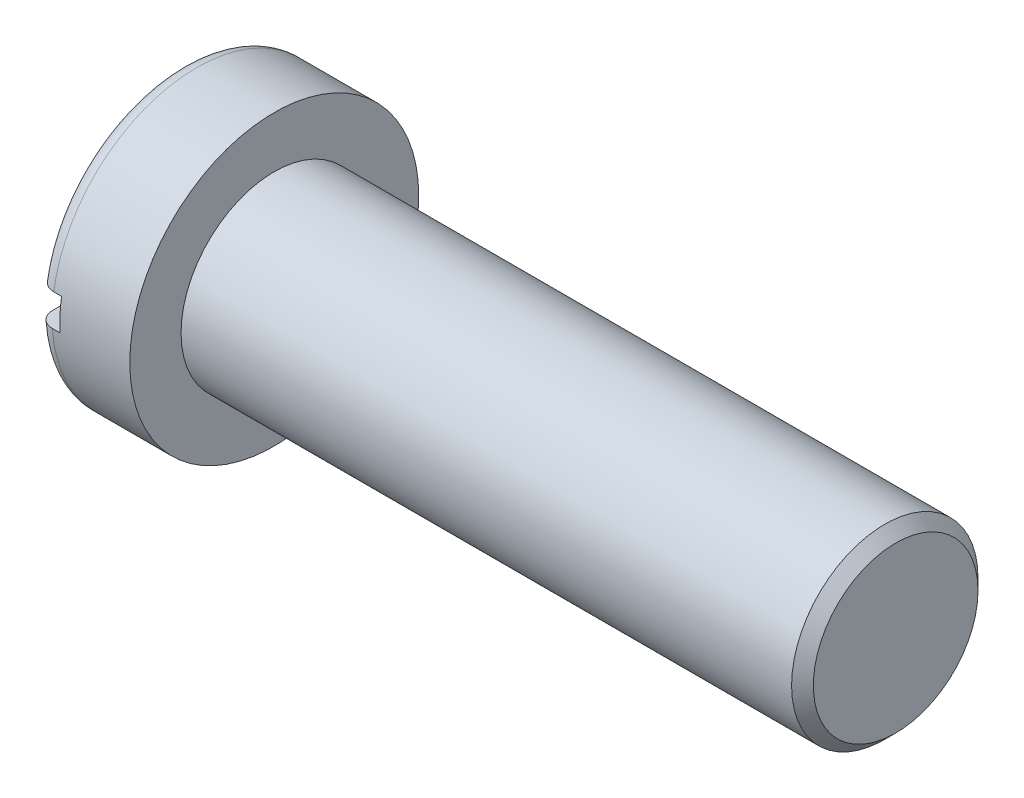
ISO-10303-21;
HEADER;
FILE_DESCRIPTION(('STEP AP214'),'2;1');
FILE_NAME('part.step','',(''),(''),'','','');
FILE_SCHEMA(('AUTOMOTIVE_DESIGN { 1 0 10303 214 1 1 1 1 }'));
ENDSEC;
DATA;
#1=APPLICATION_CONTEXT('core data for automotive mechanical design processes');
#2=APPLICATION_PROTOCOL_DEFINITION('international standard','automotive_design',2000,#1);
#3=PRODUCT_CONTEXT('',#1,'mechanical');
#4=PRODUCT('Part','Part','',(#3));
#5=PRODUCT_RELATED_PRODUCT_CATEGORY('part','',(#4));
#6=PRODUCT_DEFINITION_FORMATION('','',#4);
#7=PRODUCT_DEFINITION_CONTEXT('part definition',#1,'design');
#8=PRODUCT_DEFINITION('design','',#6,#7);
#9=PRODUCT_DEFINITION_SHAPE('','',#8);
#10=(LENGTH_UNIT() NAMED_UNIT(*) SI_UNIT(.MILLI.,.METRE.));
#11=(NAMED_UNIT(*) PLANE_ANGLE_UNIT() SI_UNIT($,.RADIAN.));
#12=(NAMED_UNIT(*) SI_UNIT($,.STERADIAN.) SOLID_ANGLE_UNIT());
#13=UNCERTAINTY_MEASURE_WITH_UNIT(LENGTH_MEASURE(1.E-05),#10,'distance_accuracy_value','');
#14=(GEOMETRIC_REPRESENTATION_CONTEXT(3) GLOBAL_UNCERTAINTY_ASSIGNED_CONTEXT((#13)) GLOBAL_UNIT_ASSIGNED_CONTEXT((#10,
#11,#12)) REPRESENTATION_CONTEXT('',''));
#15=CARTESIAN_POINT('',(0.,0.,0.));
#16=DIRECTION('',(0.,0.,1.));
#17=DIRECTION('',(1.,0.,0.));
#18=AXIS2_PLACEMENT_3D('',#15,#16,#17);
#19=CARTESIAN_POINT('',(0.,0.,0.));
#20=DIRECTION('',(-1.,0.,0.));
#21=DIRECTION('',(0.,0.,1.));
#22=AXIS2_PLACEMENT_3D('',#19,#20,#21);
#23=PLANE('',#22);
#24=DIRECTION('',(0.,0.,1.));
#25=VECTOR('',#24,1.);
#26=CARTESIAN_POINT('',(0.,-0.3,-5.));
#27=LINE('',#26,#25);
#28=CARTESIAN_POINT('',(0.,-0.3,-4.1391424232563));
#29=VERTEX_POINT('',#28);
#30=CARTESIAN_POINT('',(0.,-0.3,4.1391424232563));
#31=VERTEX_POINT('',#30);
#32=EDGE_CURVE('E121',#29,#31,#27,.T.);
#33=ORIENTED_EDGE('',*,*,#32,.F.);
#34=CARTESIAN_POINT('',(0.,0.,0.));
#35=DIRECTION('',(-1.,0.,0.));
#36=DIRECTION('',(0.,0.,1.));
#37=AXIS2_PLACEMENT_3D('',#34,#35,#36);
#38=CIRCLE('',#37,4.15);
#39=EDGE_CURVE('E99',#29,#31,#38,.T.);
#40=ORIENTED_EDGE('',*,*,#39,.T.);
#41=EDGE_LOOP('',(#33,#40));
#42=FACE_BOUND('',#41,.T.);
#43=ADVANCED_FACE('F32',(#42),#23,.T.);
#44=DIRECTION('',(0.,0.,1.));
#45=VECTOR('',#44,1.);
#46=CARTESIAN_POINT('',(0.,0.7,-5.));
#47=LINE('',#46,#45);
#48=CARTESIAN_POINT('',(0.,0.7,-4.09053786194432));
#49=VERTEX_POINT('',#48);
#50=CARTESIAN_POINT('',(0.,0.7,4.09053786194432));
#51=VERTEX_POINT('',#50);
#52=EDGE_CURVE('E117',#49,#51,#47,.T.);
#53=ORIENTED_EDGE('',*,*,#52,.T.);
#54=CARTESIAN_POINT('',(0.,0.,0.));
#55=DIRECTION('',(-1.,0.,0.));
#56=DIRECTION('',(0.,0.,1.));
#57=AXIS2_PLACEMENT_3D('',#54,#55,#56);
#58=CIRCLE('',#57,4.15);
#59=EDGE_CURVE('E188',#51,#49,#58,.T.);
#60=ORIENTED_EDGE('',*,*,#59,.T.);
#61=EDGE_LOOP('',(#53,#60));
#62=FACE_BOUND('',#61,.T.);
#63=ADVANCED_FACE('F179',(#62),#23,.T.);
#64=CARTESIAN_POINT('',(0.,0.,0.));
#65=DIRECTION('',(-1.,0.,0.));
#66=DIRECTION('',(0.,0.,1.));
#67=AXIS2_PLACEMENT_3D('',#64,#65,#66);
#68=CYLINDRICAL_SURFACE('',#67,4.65);
#69=CARTESIAN_POINT('',(3.,0.,0.));
#70=DIRECTION('',(-1.,0.,0.));
#71=DIRECTION('',(0.,0.,1.));
#72=AXIS2_PLACEMENT_3D('',#69,#70,#71);
#73=CIRCLE('',#72,4.65);
#74=CARTESIAN_POINT('',(3.,0.,4.65));
#75=VERTEX_POINT('',#74);
#76=EDGE_CURVE('E126',#75,#75,#73,.T.);
#77=ORIENTED_EDGE('',*,*,#76,.T.);
#78=EDGE_LOOP('',(#77));
#79=FACE_BOUND('',#78,.T.);
#80=DIRECTION('',(-1.,0.,0.));
#81=VECTOR('',#80,1.);
#82=CARTESIAN_POINT('',(0.,-0.3,4.64031248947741));
#83=LINE('',#82,#81);
#84=CARTESIAN_POINT('',(0.75,-0.3,4.64031248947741));
#85=VERTEX_POINT('',#84);
#86=CARTESIAN_POINT('',(0.5,-0.3,4.64031248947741));
#87=VERTEX_POINT('',#86);
#88=EDGE_CURVE('E110',#85,#87,#83,.T.);
#89=ORIENTED_EDGE('',*,*,#88,.T.);
#90=CARTESIAN_POINT('',(0.5,0.,0.));
#91=DIRECTION('',(-1.,0.,0.));
#92=DIRECTION('',(0.,0.,1.));
#93=AXIS2_PLACEMENT_3D('',#90,#91,#92);
#94=CIRCLE('',#93,4.65);
#95=CARTESIAN_POINT('',(0.5,-0.3,-4.64031248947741));
#96=VERTEX_POINT('',#95);
#97=EDGE_CURVE('E95',#87,#96,#94,.F.);
#98=ORIENTED_EDGE('',*,*,#97,.T.);
#99=DIRECTION('',(-1.,0.,0.));
#100=VECTOR('',#99,1.);
#101=CARTESIAN_POINT('',(0.,-0.3,-4.64031248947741));
#102=LINE('',#101,#100);
#103=CARTESIAN_POINT('',(0.75,-0.3,-4.64031248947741));
#104=VERTEX_POINT('',#103);
#105=EDGE_CURVE('E88',#96,#104,#102,.F.);
#106=ORIENTED_EDGE('',*,*,#105,.T.);
#107=CARTESIAN_POINT('',(0.75,0.,0.));
#108=DIRECTION('',(-1.,0.,0.));
#109=DIRECTION('',(0.,-1.,0.));
#110=AXIS2_PLACEMENT_3D('',#107,#108,#109);
#111=CIRCLE('',#110,4.65);
#112=CARTESIAN_POINT('',(0.75,0.7,-4.59700989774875));
#113=VERTEX_POINT('',#112);
#114=EDGE_CURVE('E93',#104,#113,#111,.F.);
#115=ORIENTED_EDGE('',*,*,#114,.T.);
#116=DIRECTION('',(-1.,0.,0.));
#117=VECTOR('',#116,1.);
#118=CARTESIAN_POINT('',(0.,0.7,-4.59700989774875));
#119=LINE('',#118,#117);
#120=CARTESIAN_POINT('',(0.5,0.7,-4.59700989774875));
#121=VERTEX_POINT('',#120);
#122=EDGE_CURVE('E100',#113,#121,#119,.T.);
#123=ORIENTED_EDGE('',*,*,#122,.T.);
#124=CARTESIAN_POINT('',(0.5,0.,0.));
#125=DIRECTION('',(-1.,0.,0.));
#126=DIRECTION('',(0.,0.,1.));
#127=AXIS2_PLACEMENT_3D('',#124,#125,#126);
#128=CIRCLE('',#127,4.65);
#129=CARTESIAN_POINT('',(0.5,0.7,4.59700989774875));
#130=VERTEX_POINT('',#129);
#131=EDGE_CURVE('E187',#121,#130,#128,.F.);
#132=ORIENTED_EDGE('',*,*,#131,.T.);
#133=DIRECTION('',(-1.,0.,0.));
#134=VECTOR('',#133,1.);
#135=CARTESIAN_POINT('',(0.,0.7,4.59700989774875));
#136=LINE('',#135,#134);
#137=CARTESIAN_POINT('',(0.75,0.7,4.59700989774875));
#138=VERTEX_POINT('',#137);
#139=EDGE_CURVE('E129',#130,#138,#136,.F.);
#140=ORIENTED_EDGE('',*,*,#139,.T.);
#141=EDGE_CURVE('E112',#138,#85,#111,.F.);
#142=ORIENTED_EDGE('',*,*,#141,.T.);
#143=EDGE_LOOP('',(#89,#98,#106,#115,#123,#132,#140,#142));
#144=FACE_BOUND('',#143,.T.);
#145=ADVANCED_FACE('F91',(#79,#144),#68,.T.);
#146=CARTESIAN_POINT('',(3.,4.65,0.));
#147=DIRECTION('',(1.,0.,0.));
#148=DIRECTION('',(0.,0.,-1.));
#149=AXIS2_PLACEMENT_3D('',#146,#147,#148);
#150=PLANE('',#149);
#151=CARTESIAN_POINT('',(3.,0.,0.));
#152=DIRECTION('',(-1.,0.,0.));
#153=DIRECTION('',(0.,0.,1.));
#154=AXIS2_PLACEMENT_3D('',#151,#152,#153);
#155=CIRCLE('',#154,3.);
#156=CARTESIAN_POINT('',(3.,0.,3.));
#157=VERTEX_POINT('',#156);
#158=EDGE_CURVE('E123',#157,#157,#155,.T.);
#159=ORIENTED_EDGE('',*,*,#158,.T.);
#160=EDGE_LOOP('',(#159));
#161=FACE_BOUND('',#160,.T.);
#162=ORIENTED_EDGE('',*,*,#76,.F.);
#163=EDGE_LOOP('',(#162));
#164=FACE_BOUND('',#163,.T.);
#165=ADVANCED_FACE('F193',(#161,#164),#150,.T.);
#166=CARTESIAN_POINT('',(0.,0.,0.));
#167=DIRECTION('',(-1.,0.,0.));
#168=DIRECTION('',(0.,0.,1.));
#169=AXIS2_PLACEMENT_3D('',#166,#167,#168);
#170=CYLINDRICAL_SURFACE('',#169,3.);
#171=CARTESIAN_POINT('',(22.65,0.,0.));
#172=DIRECTION('',(1.,0.,0.));
#173=DIRECTION('',(0.,0.,-1.));
#174=AXIS2_PLACEMENT_3D('',#171,#172,#173);
#175=CIRCLE('',#174,3.);
#176=CARTESIAN_POINT('',(22.65,0.,-3.));
#177=VERTEX_POINT('',#176);
#178=EDGE_CURVE('E40',#177,#177,#175,.F.);
#179=ORIENTED_EDGE('',*,*,#178,.T.);
#180=EDGE_LOOP('',(#179));
#181=FACE_BOUND('',#180,.T.);
#182=ORIENTED_EDGE('',*,*,#158,.F.);
#183=EDGE_LOOP('',(#182));
#184=FACE_BOUND('',#183,.T.);
#185=ADVANCED_FACE('F198',(#181,#184),#170,.T.);
#186=CARTESIAN_POINT('',(23.,3.,0.));
#187=DIRECTION('',(1.,0.,0.));
#188=DIRECTION('',(0.,0.,-1.));
#189=AXIS2_PLACEMENT_3D('',#186,#187,#188);
#190=PLANE('',#189);
#191=CARTESIAN_POINT('',(23.,0.,0.));
#192=DIRECTION('',(1.,0.,0.));
#193=DIRECTION('',(0.,0.,-1.));
#194=AXIS2_PLACEMENT_3D('',#191,#192,#193);
#195=CIRCLE('',#194,2.65);
#196=CARTESIAN_POINT('',(23.,0.,-2.65));
#197=VERTEX_POINT('',#196);
#198=EDGE_CURVE('E11',#197,#197,#195,.T.);
#199=ORIENTED_EDGE('',*,*,#198,.T.);
#200=EDGE_LOOP('',(#199));
#201=FACE_BOUND('',#200,.T.);
#202=ADVANCED_FACE('F203',(#201),#190,.T.);
#203=CARTESIAN_POINT('',(0.75,-0.3,-5.));
#204=DIRECTION('',(0.,1.,0.));
#205=DIRECTION('',(-1.,0.,0.));
#206=AXIS2_PLACEMENT_3D('',#203,#204,#205);
#207=PLANE('',#206);
#208=ORIENTED_EDGE('',*,*,#32,.T.);
#209=CARTESIAN_POINT('',(0.,-0.3,4.1391424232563));
#210=CARTESIAN_POINT('',(-2.37243173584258E-05,-0.3,4.16738834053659));
#211=CARTESIAN_POINT('',(0.0023795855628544,-0.3,4.19562776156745));
#212=CARTESIAN_POINT('',(0.0118675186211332,-0.3,4.25128949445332));
#213=CARTESIAN_POINT('',(0.0189488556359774,-0.3,4.27871236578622));
#214=CARTESIAN_POINT('',(0.0376253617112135,-0.3,4.33199250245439));
#215=CARTESIAN_POINT('',(0.0492228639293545,-0.3,4.35784895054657));
#216=CARTESIAN_POINT('',(0.0765962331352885,-0.3,4.40723943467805));
#217=CARTESIAN_POINT('',(0.092371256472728,-0.3,4.43077393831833));
#218=CARTESIAN_POINT('',(0.127633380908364,-0.3,4.47482223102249));
#219=CARTESIAN_POINT('',(0.147115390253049,-0.3,4.49534009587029));
#220=CARTESIAN_POINT('',(0.189259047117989,-0.3,4.53280914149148));
#221=CARTESIAN_POINT('',(0.211921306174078,-0.3,4.54975963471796));
#222=CARTESIAN_POINT('',(0.259725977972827,-0.3,4.5795699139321));
#223=CARTESIAN_POINT('',(0.284863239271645,-0.3,4.59243797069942));
#224=CARTESIAN_POINT('',(0.336938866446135,-0.3,4.61375546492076));
#225=CARTESIAN_POINT('',(0.363876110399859,-0.3,4.62220762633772));
#226=CARTESIAN_POINT('',(0.409153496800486,-0.3,4.63231373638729));
#227=CARTESIAN_POINT('',(0.427205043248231,-0.3,4.63531147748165));
#228=CARTESIAN_POINT('',(0.463501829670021,-0.3,4.63931055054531));
#229=CARTESIAN_POINT('',(0.481746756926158,-0.3,4.64031472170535));
#230=CARTESIAN_POINT('',(0.5,-0.3,4.64031248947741));
#231=B_SPLINE_CURVE_WITH_KNOTS('',3,(#209,#210,#211,#212,#213,#214,#215,#216,#217,#218,#219,
#220,#221,#222,#223,#224,#225,#226,#227,#228,#229,#230),.UNSPECIFIED.,.F.,.F.,(4,2,2,2,2,2,2,2,
2,2,4),(0.,0.0846264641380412,0.169193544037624,0.25380437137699,0.338398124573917,
0.422876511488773,0.507371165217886,0.59169352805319,0.675963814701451,0.730757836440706,
0.78547376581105),.UNSPECIFIED.);
#232=EDGE_CURVE('E142',#31,#87,#231,.T.);
#233=ORIENTED_EDGE('',*,*,#232,.T.);
#234=ORIENTED_EDGE('',*,*,#88,.F.);
#235=DIRECTION('',(0.,0.,1.));
#236=VECTOR('',#235,1.);
#237=CARTESIAN_POINT('',(0.75,-0.3,-5.));
#238=LINE('',#237,#236);
#239=EDGE_CURVE('E106',#104,#85,#238,.T.);
#240=ORIENTED_EDGE('',*,*,#239,.F.);
#241=ORIENTED_EDGE('',*,*,#105,.F.);
#242=CARTESIAN_POINT('',(0.5,-0.3,-4.64031248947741));
#243=CARTESIAN_POINT('',(0.471914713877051,-0.3,-4.6403366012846));
#244=CARTESIAN_POINT('',(0.443836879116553,-0.3,-4.63794265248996));
#245=CARTESIAN_POINT('',(0.38849908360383,-0.3,-4.62849692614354));
#246=CARTESIAN_POINT('',(0.361238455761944,-0.3,-4.62144906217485));
#247=CARTESIAN_POINT('',(0.308276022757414,-0.3,-4.60286895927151));
#248=CARTESIAN_POINT('',(0.282574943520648,-0.3,-4.59133465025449));
#249=CARTESIAN_POINT('',(0.233475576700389,-0.3,-4.56412194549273));
#250=CARTESIAN_POINT('',(0.210076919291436,-0.3,-4.54844421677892));
#251=CARTESIAN_POINT('',(0.166219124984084,-0.3,-4.51337459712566));
#252=CARTESIAN_POINT('',(0.145762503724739,-0.3,-4.49397956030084));
#253=CARTESIAN_POINT('',(0.10838388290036,-0.3,-4.4520322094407));
#254=CARTESIAN_POINT('',(0.091462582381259,-0.3,-4.42947927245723));
#255=CARTESIAN_POINT('',(0.0616008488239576,-0.3,-4.38180996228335));
#256=CARTESIAN_POINT('',(0.0486692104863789,-0.3,-4.35668808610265));
#257=CARTESIAN_POINT('',(0.0272027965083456,-0.3,-4.30463779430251));
#258=CARTESIAN_POINT('',(0.0186656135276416,-0.3,-4.27771037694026));
#259=CARTESIAN_POINT('',(0.00830715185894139,-0.3,-4.232044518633));
#260=CARTESIAN_POINT('',(0.00519372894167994,-0.3,-4.2135886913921));
#261=CARTESIAN_POINT('',(0.00104039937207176,-0.3,-4.17647189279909));
#262=CARTESIAN_POINT('',(-2.4586832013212E-06,-0.3,-4.15781125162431));
#263=CARTESIAN_POINT('',(0.,-0.3,-4.1391424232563));
#264=B_SPLINE_CURVE_WITH_KNOTS('',3,(#242,#243,#244,#245,#246,#247,#248,#249,#250,#251,#252,
#253,#254,#255,#256,#257,#258,#259,#260,#261,#262,#263),.UNSPECIFIED.,.F.,.F.,(4,2,2,2,2,2,2,2,
2,2,4),(0.,0.0841432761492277,0.16821588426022,0.252327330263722,0.33642524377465,
0.420594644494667,0.504780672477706,0.589150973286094,0.673475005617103,0.729516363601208,
0.785477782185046),.UNSPECIFIED.);
#265=EDGE_CURVE('E135',#96,#29,#264,.T.);
#266=ORIENTED_EDGE('',*,*,#265,.T.);
#267=EDGE_LOOP('',(#208,#233,#234,#240,#241,#266));
#268=FACE_BOUND('',#267,.T.);
#269=ADVANCED_FACE('F114',(#268),#207,.T.);
#270=CARTESIAN_POINT('',(0.,0.7,-5.));
#271=DIRECTION('',(0.,-1.,0.));
#272=DIRECTION('',(0.,0.,-1.));
#273=AXIS2_PLACEMENT_3D('',#270,#271,#272);
#274=PLANE('',#273);
#275=ORIENTED_EDGE('',*,*,#52,.F.);
#276=CARTESIAN_POINT('',(0.,0.7,-4.09053786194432));
#277=CARTESIAN_POINT('',(-2.29548473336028E-05,0.7,-4.11931908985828));
#278=CARTESIAN_POINT('',(0.00241309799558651,0.7,-4.14809679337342));
#279=CARTESIAN_POINT('',(0.0120469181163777,0.7,-4.20483475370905));
#280=CARTESIAN_POINT('',(0.0192431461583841,0.7,-4.23279527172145));
#281=CARTESIAN_POINT('',(0.0382477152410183,0.7,-4.28712672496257));
#282=CARTESIAN_POINT('',(0.0500592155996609,0.7,-4.31349655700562));
#283=CARTESIAN_POINT('',(0.0779706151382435,0.7,-4.36385024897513));
#284=CARTESIAN_POINT('',(0.0940691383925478,0.7,-4.38783487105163));
#285=CARTESIAN_POINT('',(0.129977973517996,0.7,-4.43254075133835));
#286=CARTESIAN_POINT('',(0.14975887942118,0.7,-4.4532856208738));
#287=CARTESIAN_POINT('',(0.192566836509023,0.7,-4.49111400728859));
#288=CARTESIAN_POINT('',(0.215594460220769,0.7,-4.50819687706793));
#289=CARTESIAN_POINT('',(0.263933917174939,0.7,-4.53799023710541));
#290=CARTESIAN_POINT('',(0.289214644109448,0.7,-4.55075126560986));
#291=CARTESIAN_POINT('',(0.341568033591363,0.7,-4.57179080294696));
#292=CARTESIAN_POINT('',(0.368639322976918,0.7,-4.58007270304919));
#293=CARTESIAN_POINT('',(0.413255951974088,0.7,-4.58965343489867));
#294=CARTESIAN_POINT('',(0.430501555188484,0.7,-4.59241057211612));
#295=CARTESIAN_POINT('',(0.465162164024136,0.7,-4.59608834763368));
#296=CARTESIAN_POINT('',(0.482576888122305,0.7,-4.59701163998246));
#297=CARTESIAN_POINT('',(0.5,0.7,-4.59700989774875));
#298=B_SPLINE_CURVE_WITH_KNOTS('',3,(#276,#277,#278,#279,#280,#281,#282,#283,#284,#285,#286,
#287,#288,#289,#290,#291,#292,#293,#294,#295,#296,#297),.UNSPECIFIED.,.F.,.F.,(4,2,2,2,2,2,2,2,
2,2,4),(0.,0.0862361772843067,0.172444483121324,0.258711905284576,0.344951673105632,
0.43053021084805,0.516123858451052,0.600678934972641,0.685169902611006,0.737474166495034,
0.789702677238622),.UNSPECIFIED.);
#299=EDGE_CURVE('E55',#49,#121,#298,.T.);
#300=ORIENTED_EDGE('',*,*,#299,.T.);
#301=ORIENTED_EDGE('',*,*,#122,.F.);
#302=DIRECTION('',(0.,0.,1.));
#303=VECTOR('',#302,1.);
#304=CARTESIAN_POINT('',(0.75,0.7,-5.));
#305=LINE('',#304,#303);
#306=EDGE_CURVE('E109',#113,#138,#305,.T.);
#307=ORIENTED_EDGE('',*,*,#306,.T.);
#308=ORIENTED_EDGE('',*,*,#139,.F.);
#309=CARTESIAN_POINT('',(0.5,0.7,4.59700989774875));
#310=CARTESIAN_POINT('',(0.472110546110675,0.7,4.59703498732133));
#311=CARTESIAN_POINT('',(0.444229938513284,0.7,4.59465109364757));
#312=CARTESIAN_POINT('',(0.389290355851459,0.7,4.58525248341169));
#313=CARTESIAN_POINT('',(0.362230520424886,0.7,4.57824280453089));
#314=CARTESIAN_POINT('',(0.309662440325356,0.7,4.55977552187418));
#315=CARTESIAN_POINT('',(0.284154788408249,0.7,4.54831623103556));
#316=CARTESIAN_POINT('',(0.235415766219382,0.7,4.52130016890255));
#317=CARTESIAN_POINT('',(0.212184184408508,0.7,4.50574377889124));
#318=CARTESIAN_POINT('',(0.168529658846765,0.7,4.47090537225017));
#319=CARTESIAN_POINT('',(0.148120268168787,0.7,4.45160637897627));
#320=CARTESIAN_POINT('',(0.110785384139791,0.7,4.40988526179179));
#321=CARTESIAN_POINT('',(0.0938606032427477,0.7,4.38746250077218));
#322=CARTESIAN_POINT('',(0.0637773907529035,0.7,4.33987207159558));
#323=CARTESIAN_POINT('',(0.0506627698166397,0.7,4.31467674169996));
#324=CARTESIAN_POINT('',(0.0287964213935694,0.7,4.26246352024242));
#325=CARTESIAN_POINT('',(0.0200430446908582,0.7,4.23544632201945));
#326=CARTESIAN_POINT('',(0.00906438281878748,0.7,4.18867592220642));
#327=CARTESIAN_POINT('',(0.00566647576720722,0.7,4.16918930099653));
#328=CARTESIAN_POINT('',(0.00113443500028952,0.7,4.12998335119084));
#329=CARTESIAN_POINT('',(-2.99131680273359E-06,0.7,4.11026440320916));
#330=CARTESIAN_POINT('',(0.,0.7,4.09053786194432));
#331=B_SPLINE_CURVE_WITH_KNOTS('',3,(#309,#310,#311,#312,#313,#314,#315,#316,#317,#318,#319,
#320,#321,#322,#323,#324,#325,#326,#327,#328,#329,#330),.UNSPECIFIED.,.F.,.F.,(4,2,2,2,2,2,2,2,
2,2,4),(0.,0.0835536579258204,0.167016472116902,0.250510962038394,0.333997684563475,
0.417872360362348,0.501764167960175,0.586585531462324,0.671374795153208,0.730593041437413,
0.78972496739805),.UNSPECIFIED.);
#332=EDGE_CURVE('E47',#130,#51,#331,.T.);
#333=ORIENTED_EDGE('',*,*,#332,.T.);
#334=EDGE_LOOP('',(#275,#300,#301,#307,#308,#333));
#335=FACE_BOUND('',#334,.T.);
#336=ADVANCED_FACE('F170',(#335),#274,.T.);
#337=CARTESIAN_POINT('',(0.75,0.7,-5.));
#338=DIRECTION('',(-1.,0.,0.));
#339=DIRECTION('',(0.,-1.,0.));
#340=AXIS2_PLACEMENT_3D('',#337,#338,#339);
#341=PLANE('',#340);
#342=ORIENTED_EDGE('',*,*,#239,.T.);
#343=ORIENTED_EDGE('',*,*,#141,.F.);
#344=ORIENTED_EDGE('',*,*,#306,.F.);
#345=ORIENTED_EDGE('',*,*,#114,.F.);
#346=EDGE_LOOP('',(#342,#343,#344,#345));
#347=FACE_BOUND('',#346,.T.);
#348=ADVANCED_FACE('F104',(#347),#341,.T.);
#349=CARTESIAN_POINT('',(0.5,0.,0.));
#350=DIRECTION('',(-1.,0.,0.));
#351=DIRECTION('',(0.,0.,1.));
#352=AXIS2_PLACEMENT_3D('',#349,#350,#351);
#353=TOROIDAL_SURFACE('',#352,4.15,0.5);
#354=ORIENTED_EDGE('',*,*,#265,.F.);
#355=ORIENTED_EDGE('',*,*,#97,.F.);
#356=ORIENTED_EDGE('',*,*,#232,.F.);
#357=ORIENTED_EDGE('',*,*,#39,.F.);
#358=EDGE_LOOP('',(#354,#355,#356,#357));
#359=FACE_BOUND('',#358,.T.);
#360=ADVANCED_FACE('F150',(#359),#353,.T.);
#361=CARTESIAN_POINT('',(0.5,0.,0.));
#362=DIRECTION('',(-1.,0.,0.));
#363=DIRECTION('',(0.,0.,1.));
#364=AXIS2_PLACEMENT_3D('',#361,#362,#363);
#365=TOROIDAL_SURFACE('',#364,4.15,0.5);
#366=ORIENTED_EDGE('',*,*,#332,.F.);
#367=ORIENTED_EDGE('',*,*,#131,.F.);
#368=ORIENTED_EDGE('',*,*,#299,.F.);
#369=ORIENTED_EDGE('',*,*,#59,.F.);
#370=EDGE_LOOP('',(#366,#367,#368,#369));
#371=FACE_BOUND('',#370,.T.);
#372=ADVANCED_FACE('F154',(#371),#365,.T.);
#373=CARTESIAN_POINT('',(22.65,0.,0.));
#374=DIRECTION('',(-1.,0.,0.));
#375=DIRECTION('',(0.,0.,1.));
#376=AXIS2_PLACEMENT_3D('',#373,#374,#375);
#377=CONICAL_SURFACE('',#376,3.,0.785398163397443);
#378=ORIENTED_EDGE('',*,*,#198,.F.);
#379=EDGE_LOOP('',(#378));
#380=FACE_BOUND('',#379,.T.);
#381=ORIENTED_EDGE('',*,*,#178,.F.);
#382=EDGE_LOOP('',(#381));
#383=FACE_BOUND('',#382,.T.);
#384=ADVANCED_FACE('F34',(#380,#383),#377,.T.);
#385=CLOSED_SHELL('',(#43,#63,#145,#165,#185,#202,#269,#336,#348,#360,#372,#384));
#386=MANIFOLD_SOLID_BREP('B2',#385);
#387=ADVANCED_BREP_SHAPE_REPRESENTATION('',(#18,#386),#14);
#388=SHAPE_DEFINITION_REPRESENTATION(#9,#387);
ENDSEC;
END-ISO-10303-21;
